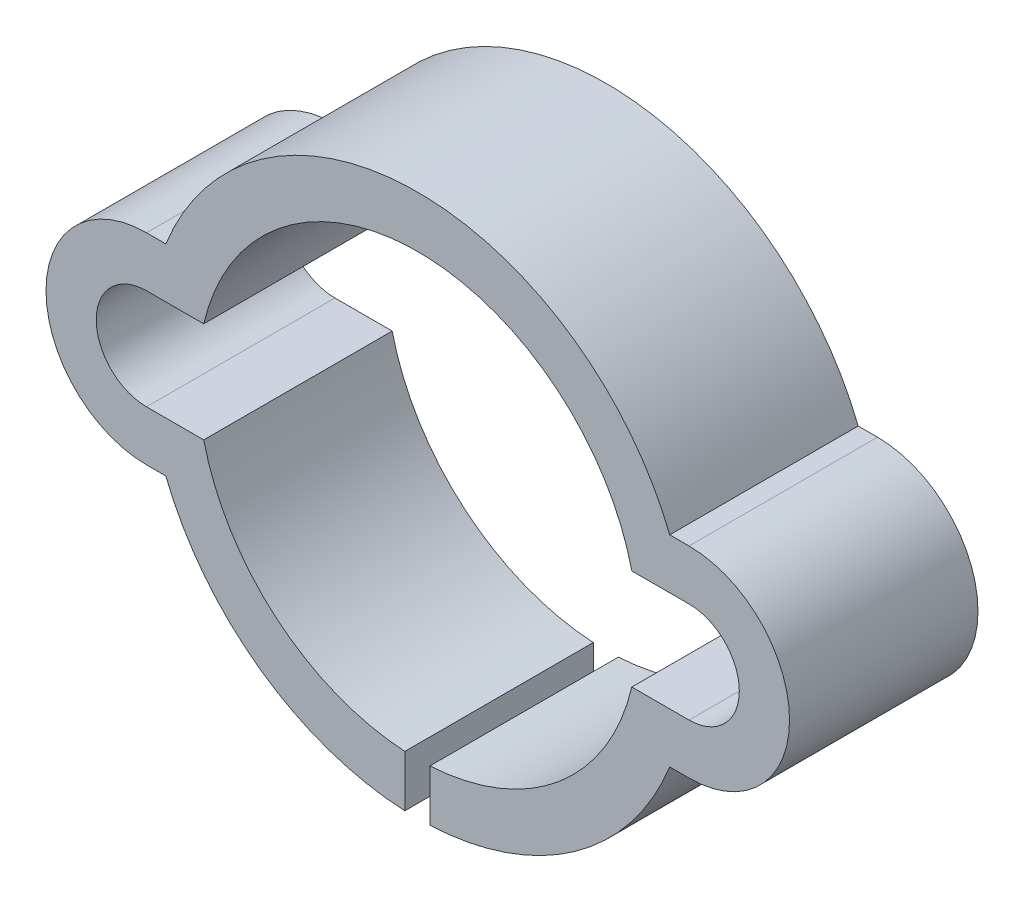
ISO-10303-21;
HEADER;
FILE_DESCRIPTION(('STEP AP214'),'2;1');
FILE_NAME('part.step','',(''),(''),'','','');
FILE_SCHEMA(('AUTOMOTIVE_DESIGN { 1 0 10303 214 1 1 1 1 }'));
ENDSEC;
DATA;
#1=APPLICATION_CONTEXT('core data for automotive mechanical design processes');
#2=APPLICATION_PROTOCOL_DEFINITION('international standard','automotive_design',2000,#1);
#3=PRODUCT_CONTEXT('',#1,'mechanical');
#4=PRODUCT('Part','Part','',(#3));
#5=PRODUCT_RELATED_PRODUCT_CATEGORY('part','',(#4));
#6=PRODUCT_DEFINITION_FORMATION('','',#4);
#7=PRODUCT_DEFINITION_CONTEXT('part definition',#1,'design');
#8=PRODUCT_DEFINITION('design','',#6,#7);
#9=PRODUCT_DEFINITION_SHAPE('','',#8);
#10=(LENGTH_UNIT() NAMED_UNIT(*) SI_UNIT(.MILLI.,.METRE.));
#11=(NAMED_UNIT(*) PLANE_ANGLE_UNIT() SI_UNIT($,.RADIAN.));
#12=(NAMED_UNIT(*) SI_UNIT($,.STERADIAN.) SOLID_ANGLE_UNIT());
#13=UNCERTAINTY_MEASURE_WITH_UNIT(LENGTH_MEASURE(1.E-05),#10,'distance_accuracy_value','');
#14=(GEOMETRIC_REPRESENTATION_CONTEXT(3) GLOBAL_UNCERTAINTY_ASSIGNED_CONTEXT((#13)) GLOBAL_UNIT_ASSIGNED_CONTEXT((#10,
#11,#12)) REPRESENTATION_CONTEXT('',''));
#15=CARTESIAN_POINT('',(0.,0.,0.));
#16=DIRECTION('',(0.,0.,1.));
#17=DIRECTION('',(1.,0.,0.));
#18=AXIS2_PLACEMENT_3D('',#15,#16,#17);
#19=CARTESIAN_POINT('',(0.,0.,3.));
#20=DIRECTION('',(0.,0.,-1.));
#21=DIRECTION('',(-1.,0.,0.));
#22=AXIS2_PLACEMENT_3D('',#19,#20,#21);
#23=CYLINDRICAL_SURFACE('',#22,4.31837483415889);
#24=CARTESIAN_POINT('',(0.,0.,0.));
#25=DIRECTION('',(0.,0.,1.));
#26=DIRECTION('',(1.,0.,0.));
#27=AXIS2_PLACEMENT_3D('',#24,#25,#26);
#28=CIRCLE('',#27,4.31837483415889);
#29=CARTESIAN_POINT('',(4.01102994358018,1.6,0.));
#30=VERTEX_POINT('',#29);
#31=CARTESIAN_POINT('',(-4.01102994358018,1.6,0.));
#32=VERTEX_POINT('',#31);
#33=EDGE_CURVE('E212',#30,#32,#28,.T.);
#34=ORIENTED_EDGE('',*,*,#33,.T.);
#35=DIRECTION('',(0.,0.,-1.));
#36=VECTOR('',#35,1.);
#37=CARTESIAN_POINT('',(-4.01102994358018,1.6,3.));
#38=LINE('',#37,#36);
#39=CARTESIAN_POINT('',(-4.01102994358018,1.6,3.));
#40=VERTEX_POINT('',#39);
#41=EDGE_CURVE('E11',#40,#32,#38,.T.);
#42=ORIENTED_EDGE('',*,*,#41,.F.);
#43=CARTESIAN_POINT('',(0.,0.,3.));
#44=DIRECTION('',(0.,0.,1.));
#45=DIRECTION('',(1.,0.,0.));
#46=AXIS2_PLACEMENT_3D('',#43,#44,#45);
#47=CIRCLE('',#46,4.31837483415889);
#48=CARTESIAN_POINT('',(4.01102994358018,1.6,3.));
#49=VERTEX_POINT('',#48);
#50=EDGE_CURVE('E270',#49,#40,#47,.T.);
#51=ORIENTED_EDGE('',*,*,#50,.F.);
#52=DIRECTION('',(0.,0.,-1.));
#53=VECTOR('',#52,1.);
#54=CARTESIAN_POINT('',(4.01102994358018,1.6,3.));
#55=LINE('',#54,#53);
#56=EDGE_CURVE('E208',#49,#30,#55,.T.);
#57=ORIENTED_EDGE('',*,*,#56,.T.);
#58=EDGE_LOOP('',(#34,#42,#51,#57));
#59=FACE_BOUND('',#58,.T.);
#60=ADVANCED_FACE('F39',(#59),#23,.T.);
#61=CARTESIAN_POINT('',(-4.31837483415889,1.6,3.));
#62=DIRECTION('',(0.,-1.,0.));
#63=DIRECTION('',(0.,0.,-1.));
#64=AXIS2_PLACEMENT_3D('',#61,#62,#63);
#65=PLANE('',#64);
#66=DIRECTION('',(-1.,0.,0.));
#67=VECTOR('',#66,1.);
#68=CARTESIAN_POINT('',(-4.31837483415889,1.6,0.));
#69=LINE('',#68,#67);
#70=CARTESIAN_POINT('',(-4.31837483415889,1.6,0.));
#71=VERTEX_POINT('',#70);
#72=EDGE_CURVE('E216',#32,#71,#69,.T.);
#73=ORIENTED_EDGE('',*,*,#72,.T.);
#74=DIRECTION('',(0.,0.,-1.));
#75=VECTOR('',#74,1.);
#76=CARTESIAN_POINT('',(-4.31837483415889,1.6,3.));
#77=LINE('',#76,#75);
#78=CARTESIAN_POINT('',(-4.31837483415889,1.6,3.));
#79=VERTEX_POINT('',#78);
#80=EDGE_CURVE('E48',#79,#71,#77,.T.);
#81=ORIENTED_EDGE('',*,*,#80,.F.);
#82=DIRECTION('',(-1.,0.,0.));
#83=VECTOR('',#82,1.);
#84=CARTESIAN_POINT('',(-4.31837483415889,1.6,3.));
#85=LINE('',#84,#83);
#86=EDGE_CURVE('E135',#40,#79,#85,.T.);
#87=ORIENTED_EDGE('',*,*,#86,.F.);
#88=ORIENTED_EDGE('',*,*,#41,.T.);
#89=EDGE_LOOP('',(#73,#81,#87,#88));
#90=FACE_BOUND('',#89,.T.);
#91=ADVANCED_FACE('F420',(#90),#65,.F.);
#92=CARTESIAN_POINT('',(-4.31837483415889,0.,3.));
#93=DIRECTION('',(0.,0.,-1.));
#94=DIRECTION('',(-1.,0.,0.));
#95=AXIS2_PLACEMENT_3D('',#92,#93,#94);
#96=CYLINDRICAL_SURFACE('',#95,1.6);
#97=CARTESIAN_POINT('',(-4.31837483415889,0.,0.));
#98=DIRECTION('',(0.,0.,1.));
#99=DIRECTION('',(1.,0.,0.));
#100=AXIS2_PLACEMENT_3D('',#97,#98,#99);
#101=CIRCLE('',#100,1.6);
#102=CARTESIAN_POINT('',(-4.31837483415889,-1.6,0.));
#103=VERTEX_POINT('',#102);
#104=EDGE_CURVE('E219',#71,#103,#101,.T.);
#105=ORIENTED_EDGE('',*,*,#104,.T.);
#106=DIRECTION('',(0.,0.,-1.));
#107=VECTOR('',#106,1.);
#108=CARTESIAN_POINT('',(-4.31837483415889,-1.6,3.));
#109=LINE('',#108,#107);
#110=CARTESIAN_POINT('',(-4.31837483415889,-1.6,3.));
#111=VERTEX_POINT('',#110);
#112=EDGE_CURVE('E329',#111,#103,#109,.T.);
#113=ORIENTED_EDGE('',*,*,#112,.F.);
#114=CARTESIAN_POINT('',(-4.31837483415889,0.,3.));
#115=DIRECTION('',(0.,0.,1.));
#116=DIRECTION('',(1.,0.,0.));
#117=AXIS2_PLACEMENT_3D('',#114,#115,#116);
#118=CIRCLE('',#117,1.6);
#119=EDGE_CURVE('E339',#79,#111,#118,.T.);
#120=ORIENTED_EDGE('',*,*,#119,.F.);
#121=ORIENTED_EDGE('',*,*,#80,.T.);
#122=EDGE_LOOP('',(#105,#113,#120,#121));
#123=FACE_BOUND('',#122,.T.);
#124=ADVANCED_FACE('F337',(#123),#96,.T.);
#125=CARTESIAN_POINT('',(-4.31837483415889,-1.6,3.));
#126=DIRECTION('',(0.,1.,0.));
#127=DIRECTION('',(0.,0.,1.));
#128=AXIS2_PLACEMENT_3D('',#125,#126,#127);
#129=PLANE('',#128);
#130=DIRECTION('',(1.,0.,0.));
#131=VECTOR('',#130,1.);
#132=CARTESIAN_POINT('',(-4.31837483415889,-1.6,0.));
#133=LINE('',#132,#131);
#134=CARTESIAN_POINT('',(-4.01102994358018,-1.6,0.));
#135=VERTEX_POINT('',#134);
#136=EDGE_CURVE('E222',#103,#135,#133,.T.);
#137=ORIENTED_EDGE('',*,*,#136,.T.);
#138=DIRECTION('',(0.,0.,-1.));
#139=VECTOR('',#138,1.);
#140=CARTESIAN_POINT('',(-4.01102994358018,-1.6,3.));
#141=LINE('',#140,#139);
#142=CARTESIAN_POINT('',(-4.01102994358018,-1.6,3.));
#143=VERTEX_POINT('',#142);
#144=EDGE_CURVE('E325',#143,#135,#141,.T.);
#145=ORIENTED_EDGE('',*,*,#144,.F.);
#146=DIRECTION('',(1.,0.,0.));
#147=VECTOR('',#146,1.);
#148=CARTESIAN_POINT('',(-4.31837483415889,-1.6,3.));
#149=LINE('',#148,#147);
#150=EDGE_CURVE('E358',#111,#143,#149,.T.);
#151=ORIENTED_EDGE('',*,*,#150,.F.);
#152=ORIENTED_EDGE('',*,*,#112,.T.);
#153=EDGE_LOOP('',(#137,#145,#151,#152));
#154=FACE_BOUND('',#153,.T.);
#155=ADVANCED_FACE('F348',(#154),#129,.F.);
#156=CARTESIAN_POINT('',(0.,0.,3.));
#157=DIRECTION('',(0.,0.,-1.));
#158=DIRECTION('',(-1.,0.,0.));
#159=AXIS2_PLACEMENT_3D('',#156,#157,#158);
#160=CYLINDRICAL_SURFACE('',#159,4.31837483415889);
#161=CARTESIAN_POINT('',(0.,0.,0.));
#162=DIRECTION('',(0.,0.,1.));
#163=DIRECTION('',(1.,0.,0.));
#164=AXIS2_PLACEMENT_3D('',#161,#162,#163);
#165=CIRCLE('',#164,4.31837483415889);
#166=CARTESIAN_POINT('',(-0.205945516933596,-4.31346121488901,0.));
#167=VERTEX_POINT('',#166);
#168=EDGE_CURVE('E225',#135,#167,#165,.T.);
#169=ORIENTED_EDGE('',*,*,#168,.T.);
#170=DIRECTION('',(0.,0.,-1.));
#171=VECTOR('',#170,1.);
#172=CARTESIAN_POINT('',(-0.205945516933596,-4.31346121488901,3.));
#173=LINE('',#172,#171);
#174=CARTESIAN_POINT('',(-0.205945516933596,-4.31346121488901,3.));
#175=VERTEX_POINT('',#174);
#176=EDGE_CURVE('E321',#175,#167,#173,.T.);
#177=ORIENTED_EDGE('',*,*,#176,.F.);
#178=CARTESIAN_POINT('',(0.,0.,3.));
#179=DIRECTION('',(0.,0.,1.));
#180=DIRECTION('',(1.,0.,0.));
#181=AXIS2_PLACEMENT_3D('',#178,#179,#180);
#182=CIRCLE('',#181,4.31837483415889);
#183=EDGE_CURVE('E354',#143,#175,#182,.T.);
#184=ORIENTED_EDGE('',*,*,#183,.F.);
#185=ORIENTED_EDGE('',*,*,#144,.T.);
#186=EDGE_LOOP('',(#169,#177,#184,#185));
#187=FACE_BOUND('',#186,.T.);
#188=ADVANCED_FACE('F352',(#187),#160,.T.);
#189=CARTESIAN_POINT('',(-0.205945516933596,-3.49393566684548,3.));
#190=DIRECTION('',(-1.,0.,0.));
#191=DIRECTION('',(0.,0.,1.));
#192=AXIS2_PLACEMENT_3D('',#189,#190,#191);
#193=PLANE('',#192);
#194=DIRECTION('',(0.,1.,0.));
#195=VECTOR('',#194,1.);
#196=CARTESIAN_POINT('',(-0.205945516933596,-3.49393566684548,0.));
#197=LINE('',#196,#195);
#198=CARTESIAN_POINT('',(-0.205945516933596,-3.49393566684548,0.));
#199=VERTEX_POINT('',#198);
#200=EDGE_CURVE('E228',#167,#199,#197,.T.);
#201=ORIENTED_EDGE('',*,*,#200,.T.);
#202=DIRECTION('',(0.,0.,-1.));
#203=VECTOR('',#202,1.);
#204=CARTESIAN_POINT('',(-0.205945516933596,-3.49393566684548,3.));
#205=LINE('',#204,#203);
#206=CARTESIAN_POINT('',(-0.205945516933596,-3.49393566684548,3.));
#207=VERTEX_POINT('',#206);
#208=EDGE_CURVE('E317',#207,#199,#205,.T.);
#209=ORIENTED_EDGE('',*,*,#208,.F.);
#210=DIRECTION('',(0.,1.,0.));
#211=VECTOR('',#210,1.);
#212=CARTESIAN_POINT('',(-0.205945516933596,-3.49393566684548,3.));
#213=LINE('',#212,#211);
#214=EDGE_CURVE('E357',#175,#207,#213,.T.);
#215=ORIENTED_EDGE('',*,*,#214,.F.);
#216=ORIENTED_EDGE('',*,*,#176,.T.);
#217=EDGE_LOOP('',(#201,#209,#215,#216));
#218=FACE_BOUND('',#217,.T.);
#219=ADVANCED_FACE('F433',(#218),#193,.F.);
#220=CARTESIAN_POINT('',(0.,0.,3.));
#221=DIRECTION('',(0.,0.,-1.));
#222=DIRECTION('',(-1.,0.,0.));
#223=AXIS2_PLACEMENT_3D('',#220,#221,#222);
#224=CYLINDRICAL_SURFACE('',#223,3.5);
#225=CARTESIAN_POINT('',(0.,0.,0.));
#226=DIRECTION('',(0.,0.,-1.));
#227=DIRECTION('',(1.,0.,0.));
#228=AXIS2_PLACEMENT_3D('',#225,#226,#227);
#229=CIRCLE('',#228,3.5);
#230=CARTESIAN_POINT('',(-3.40734500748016,-0.8,0.));
#231=VERTEX_POINT('',#230);
#232=EDGE_CURVE('E231',#199,#231,#229,.T.);
#233=ORIENTED_EDGE('',*,*,#232,.T.);
#234=DIRECTION('',(0.,0.,-1.));
#235=VECTOR('',#234,1.);
#236=CARTESIAN_POINT('',(-3.40734500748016,-0.8,3.));
#237=LINE('',#236,#235);
#238=CARTESIAN_POINT('',(-3.40734500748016,-0.8,3.));
#239=VERTEX_POINT('',#238);
#240=EDGE_CURVE('E313',#239,#231,#237,.T.);
#241=ORIENTED_EDGE('',*,*,#240,.F.);
#242=CARTESIAN_POINT('',(0.,0.,3.));
#243=DIRECTION('',(0.,0.,-1.));
#244=DIRECTION('',(1.,0.,0.));
#245=AXIS2_PLACEMENT_3D('',#242,#243,#244);
#246=CIRCLE('',#245,3.5);
#247=EDGE_CURVE('E362',#207,#239,#246,.T.);
#248=ORIENTED_EDGE('',*,*,#247,.F.);
#249=ORIENTED_EDGE('',*,*,#208,.T.);
#250=EDGE_LOOP('',(#233,#241,#248,#249));
#251=FACE_BOUND('',#250,.T.);
#252=ADVANCED_FACE('F436',(#251),#224,.F.);
#253=CARTESIAN_POINT('',(-4.31837483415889,-0.8,3.));
#254=DIRECTION('',(0.,-1.,0.));
#255=DIRECTION('',(0.,0.,-1.));
#256=AXIS2_PLACEMENT_3D('',#253,#254,#255);
#257=PLANE('',#256);
#258=DIRECTION('',(-1.,0.,0.));
#259=VECTOR('',#258,1.);
#260=CARTESIAN_POINT('',(-4.31837483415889,-0.8,0.));
#261=LINE('',#260,#259);
#262=CARTESIAN_POINT('',(-4.31837483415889,-0.8,0.));
#263=VERTEX_POINT('',#262);
#264=EDGE_CURVE('E234',#231,#263,#261,.T.);
#265=ORIENTED_EDGE('',*,*,#264,.T.);
#266=DIRECTION('',(0.,0.,-1.));
#267=VECTOR('',#266,1.);
#268=CARTESIAN_POINT('',(-4.31837483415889,-0.8,3.));
#269=LINE('',#268,#267);
#270=CARTESIAN_POINT('',(-4.31837483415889,-0.8,3.));
#271=VERTEX_POINT('',#270);
#272=EDGE_CURVE('E309',#271,#263,#269,.T.);
#273=ORIENTED_EDGE('',*,*,#272,.F.);
#274=DIRECTION('',(-1.,0.,0.));
#275=VECTOR('',#274,1.);
#276=CARTESIAN_POINT('',(-4.31837483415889,-0.8,3.));
#277=LINE('',#276,#275);
#278=EDGE_CURVE('E369',#239,#271,#277,.T.);
#279=ORIENTED_EDGE('',*,*,#278,.F.);
#280=ORIENTED_EDGE('',*,*,#240,.T.);
#281=EDGE_LOOP('',(#265,#273,#279,#280));
#282=FACE_BOUND('',#281,.T.);
#283=ADVANCED_FACE('F440',(#282),#257,.F.);
#284=CARTESIAN_POINT('',(-4.31837483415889,0.,3.));
#285=DIRECTION('',(0.,0.,-1.));
#286=DIRECTION('',(-1.,0.,0.));
#287=AXIS2_PLACEMENT_3D('',#284,#285,#286);
#288=CYLINDRICAL_SURFACE('',#287,0.8);
#289=CARTESIAN_POINT('',(-4.31837483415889,0.,0.));
#290=DIRECTION('',(0.,0.,-1.));
#291=DIRECTION('',(1.,0.,0.));
#292=AXIS2_PLACEMENT_3D('',#289,#290,#291);
#293=CIRCLE('',#292,0.8);
#294=CARTESIAN_POINT('',(-4.31837483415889,0.8,0.));
#295=VERTEX_POINT('',#294);
#296=EDGE_CURVE('E237',#263,#295,#293,.T.);
#297=ORIENTED_EDGE('',*,*,#296,.T.);
#298=DIRECTION('',(0.,0.,-1.));
#299=VECTOR('',#298,1.);
#300=CARTESIAN_POINT('',(-4.31837483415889,0.8,3.));
#301=LINE('',#300,#299);
#302=CARTESIAN_POINT('',(-4.31837483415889,0.8,3.));
#303=VERTEX_POINT('',#302);
#304=EDGE_CURVE('E305',#303,#295,#301,.T.);
#305=ORIENTED_EDGE('',*,*,#304,.F.);
#306=CARTESIAN_POINT('',(-4.31837483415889,0.,3.));
#307=DIRECTION('',(0.,0.,-1.));
#308=DIRECTION('',(1.,0.,0.));
#309=AXIS2_PLACEMENT_3D('',#306,#307,#308);
#310=CIRCLE('',#309,0.8);
#311=EDGE_CURVE('E372',#271,#303,#310,.T.);
#312=ORIENTED_EDGE('',*,*,#311,.F.);
#313=ORIENTED_EDGE('',*,*,#272,.T.);
#314=EDGE_LOOP('',(#297,#305,#312,#313));
#315=FACE_BOUND('',#314,.T.);
#316=ADVANCED_FACE('F444',(#315),#288,.F.);
#317=CARTESIAN_POINT('',(-4.31837483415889,0.8,3.));
#318=DIRECTION('',(0.,1.,0.));
#319=DIRECTION('',(0.,0.,1.));
#320=AXIS2_PLACEMENT_3D('',#317,#318,#319);
#321=PLANE('',#320);
#322=DIRECTION('',(1.,0.,0.));
#323=VECTOR('',#322,1.);
#324=CARTESIAN_POINT('',(-4.31837483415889,0.8,0.));
#325=LINE('',#324,#323);
#326=CARTESIAN_POINT('',(-3.40734500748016,0.8,0.));
#327=VERTEX_POINT('',#326);
#328=EDGE_CURVE('E240',#295,#327,#325,.T.);
#329=ORIENTED_EDGE('',*,*,#328,.T.);
#330=DIRECTION('',(0.,0.,-1.));
#331=VECTOR('',#330,1.);
#332=CARTESIAN_POINT('',(-3.40734500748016,0.8,3.));
#333=LINE('',#332,#331);
#334=CARTESIAN_POINT('',(-3.40734500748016,0.8,3.));
#335=VERTEX_POINT('',#334);
#336=EDGE_CURVE('E301',#335,#327,#333,.T.);
#337=ORIENTED_EDGE('',*,*,#336,.F.);
#338=DIRECTION('',(1.,0.,0.));
#339=VECTOR('',#338,1.);
#340=CARTESIAN_POINT('',(-4.31837483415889,0.8,3.));
#341=LINE('',#340,#339);
#342=EDGE_CURVE('E375',#303,#335,#341,.T.);
#343=ORIENTED_EDGE('',*,*,#342,.F.);
#344=ORIENTED_EDGE('',*,*,#304,.T.);
#345=EDGE_LOOP('',(#329,#337,#343,#344));
#346=FACE_BOUND('',#345,.T.);
#347=ADVANCED_FACE('F448',(#346),#321,.F.);
#348=CARTESIAN_POINT('',(0.,0.,3.));
#349=DIRECTION('',(0.,0.,-1.));
#350=DIRECTION('',(-1.,0.,0.));
#351=AXIS2_PLACEMENT_3D('',#348,#349,#350);
#352=CYLINDRICAL_SURFACE('',#351,3.5);
#353=CARTESIAN_POINT('',(0.,0.,0.));
#354=DIRECTION('',(0.,0.,-1.));
#355=DIRECTION('',(1.,0.,0.));
#356=AXIS2_PLACEMENT_3D('',#353,#354,#355);
#357=CIRCLE('',#356,3.5);
#358=CARTESIAN_POINT('',(3.40734500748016,0.8,0.));
#359=VERTEX_POINT('',#358);
#360=EDGE_CURVE('E243',#327,#359,#357,.T.);
#361=ORIENTED_EDGE('',*,*,#360,.T.);
#362=DIRECTION('',(0.,0.,-1.));
#363=VECTOR('',#362,1.);
#364=CARTESIAN_POINT('',(3.40734500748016,0.8,3.));
#365=LINE('',#364,#363);
#366=CARTESIAN_POINT('',(3.40734500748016,0.8,3.));
#367=VERTEX_POINT('',#366);
#368=EDGE_CURVE('E297',#367,#359,#365,.T.);
#369=ORIENTED_EDGE('',*,*,#368,.F.);
#370=CARTESIAN_POINT('',(0.,0.,3.));
#371=DIRECTION('',(0.,0.,-1.));
#372=DIRECTION('',(1.,0.,0.));
#373=AXIS2_PLACEMENT_3D('',#370,#371,#372);
#374=CIRCLE('',#373,3.5);
#375=EDGE_CURVE('E378',#335,#367,#374,.T.);
#376=ORIENTED_EDGE('',*,*,#375,.F.);
#377=ORIENTED_EDGE('',*,*,#336,.T.);
#378=EDGE_LOOP('',(#361,#369,#376,#377));
#379=FACE_BOUND('',#378,.T.);
#380=ADVANCED_FACE('F452',(#379),#352,.F.);
#381=CARTESIAN_POINT('',(3.40734500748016,0.8,3.));
#382=DIRECTION('',(0.,1.,0.));
#383=DIRECTION('',(0.,0.,1.));
#384=AXIS2_PLACEMENT_3D('',#381,#382,#383);
#385=PLANE('',#384);
#386=DIRECTION('',(1.,0.,0.));
#387=VECTOR('',#386,1.);
#388=CARTESIAN_POINT('',(3.40734500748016,0.8,0.));
#389=LINE('',#388,#387);
#390=CARTESIAN_POINT('',(4.31837483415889,0.8,0.));
#391=VERTEX_POINT('',#390);
#392=EDGE_CURVE('E246',#359,#391,#389,.T.);
#393=ORIENTED_EDGE('',*,*,#392,.T.);
#394=DIRECTION('',(0.,0.,-1.));
#395=VECTOR('',#394,1.);
#396=CARTESIAN_POINT('',(4.31837483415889,0.8,3.));
#397=LINE('',#396,#395);
#398=CARTESIAN_POINT('',(4.31837483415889,0.8,3.));
#399=VERTEX_POINT('',#398);
#400=EDGE_CURVE('E293',#399,#391,#397,.T.);
#401=ORIENTED_EDGE('',*,*,#400,.F.);
#402=DIRECTION('',(1.,0.,0.));
#403=VECTOR('',#402,1.);
#404=CARTESIAN_POINT('',(3.40734500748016,0.8,3.));
#405=LINE('',#404,#403);
#406=EDGE_CURVE('E381',#367,#399,#405,.T.);
#407=ORIENTED_EDGE('',*,*,#406,.F.);
#408=ORIENTED_EDGE('',*,*,#368,.T.);
#409=EDGE_LOOP('',(#393,#401,#407,#408));
#410=FACE_BOUND('',#409,.T.);
#411=ADVANCED_FACE('F456',(#410),#385,.F.);
#412=CARTESIAN_POINT('',(4.31837483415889,0.,3.));
#413=DIRECTION('',(0.,0.,-1.));
#414=DIRECTION('',(-1.,0.,0.));
#415=AXIS2_PLACEMENT_3D('',#412,#413,#414);
#416=CYLINDRICAL_SURFACE('',#415,0.8);
#417=CARTESIAN_POINT('',(4.31837483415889,0.,0.));
#418=DIRECTION('',(0.,0.,-1.));
#419=DIRECTION('',(1.,0.,0.));
#420=AXIS2_PLACEMENT_3D('',#417,#418,#419);
#421=CIRCLE('',#420,0.8);
#422=CARTESIAN_POINT('',(4.31837483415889,-0.8,0.));
#423=VERTEX_POINT('',#422);
#424=EDGE_CURVE('E249',#391,#423,#421,.T.);
#425=ORIENTED_EDGE('',*,*,#424,.T.);
#426=DIRECTION('',(0.,0.,-1.));
#427=VECTOR('',#426,1.);
#428=CARTESIAN_POINT('',(4.31837483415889,-0.8,3.));
#429=LINE('',#428,#427);
#430=CARTESIAN_POINT('',(4.31837483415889,-0.8,3.));
#431=VERTEX_POINT('',#430);
#432=EDGE_CURVE('E289',#431,#423,#429,.T.);
#433=ORIENTED_EDGE('',*,*,#432,.F.);
#434=CARTESIAN_POINT('',(4.31837483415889,0.,3.));
#435=DIRECTION('',(0.,0.,-1.));
#436=DIRECTION('',(1.,0.,0.));
#437=AXIS2_PLACEMENT_3D('',#434,#435,#436);
#438=CIRCLE('',#437,0.8);
#439=EDGE_CURVE('E384',#399,#431,#438,.T.);
#440=ORIENTED_EDGE('',*,*,#439,.F.);
#441=ORIENTED_EDGE('',*,*,#400,.T.);
#442=EDGE_LOOP('',(#425,#433,#440,#441));
#443=FACE_BOUND('',#442,.T.);
#444=ADVANCED_FACE('F460',(#443),#416,.F.);
#445=CARTESIAN_POINT('',(3.40734500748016,-0.8,3.));
#446=DIRECTION('',(0.,-1.,0.));
#447=DIRECTION('',(0.,0.,-1.));
#448=AXIS2_PLACEMENT_3D('',#445,#446,#447);
#449=PLANE('',#448);
#450=DIRECTION('',(-1.,0.,0.));
#451=VECTOR('',#450,1.);
#452=CARTESIAN_POINT('',(3.40734500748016,-0.8,0.));
#453=LINE('',#452,#451);
#454=CARTESIAN_POINT('',(3.40734500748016,-0.800000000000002,0.));
#455=VERTEX_POINT('',#454);
#456=EDGE_CURVE('E252',#423,#455,#453,.T.);
#457=ORIENTED_EDGE('',*,*,#456,.T.);
#458=DIRECTION('',(0.,0.,-1.));
#459=VECTOR('',#458,1.);
#460=CARTESIAN_POINT('',(3.40734500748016,-0.800000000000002,3.));
#461=LINE('',#460,#459);
#462=CARTESIAN_POINT('',(3.40734500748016,-0.800000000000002,3.));
#463=VERTEX_POINT('',#462);
#464=EDGE_CURVE('E285',#463,#455,#461,.T.);
#465=ORIENTED_EDGE('',*,*,#464,.F.);
#466=DIRECTION('',(-1.,0.,0.));
#467=VECTOR('',#466,1.);
#468=CARTESIAN_POINT('',(3.40734500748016,-0.8,3.));
#469=LINE('',#468,#467);
#470=EDGE_CURVE('E387',#431,#463,#469,.T.);
#471=ORIENTED_EDGE('',*,*,#470,.F.);
#472=ORIENTED_EDGE('',*,*,#432,.T.);
#473=EDGE_LOOP('',(#457,#465,#471,#472));
#474=FACE_BOUND('',#473,.T.);
#475=ADVANCED_FACE('F464',(#474),#449,.F.);
#476=CARTESIAN_POINT('',(0.,0.,3.));
#477=DIRECTION('',(0.,0.,-1.));
#478=DIRECTION('',(-1.,0.,0.));
#479=AXIS2_PLACEMENT_3D('',#476,#477,#478);
#480=CYLINDRICAL_SURFACE('',#479,3.5);
#481=CARTESIAN_POINT('',(0.,0.,0.));
#482=DIRECTION('',(0.,0.,-1.));
#483=DIRECTION('',(1.,0.,0.));
#484=AXIS2_PLACEMENT_3D('',#481,#482,#483);
#485=CIRCLE('',#484,3.5);
#486=CARTESIAN_POINT('',(0.193174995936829,-3.49466499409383,0.));
#487=VERTEX_POINT('',#486);
#488=EDGE_CURVE('E255',#455,#487,#485,.T.);
#489=ORIENTED_EDGE('',*,*,#488,.T.);
#490=DIRECTION('',(0.,0.,-1.));
#491=VECTOR('',#490,1.);
#492=CARTESIAN_POINT('',(0.193174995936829,-3.49466499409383,3.));
#493=LINE('',#492,#491);
#494=CARTESIAN_POINT('',(0.193174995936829,-3.49466499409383,3.));
#495=VERTEX_POINT('',#494);
#496=EDGE_CURVE('E281',#495,#487,#493,.T.);
#497=ORIENTED_EDGE('',*,*,#496,.F.);
#498=CARTESIAN_POINT('',(0.,0.,3.));
#499=DIRECTION('',(0.,0.,-1.));
#500=DIRECTION('',(1.,0.,0.));
#501=AXIS2_PLACEMENT_3D('',#498,#499,#500);
#502=CIRCLE('',#501,3.5);
#503=EDGE_CURVE('E390',#463,#495,#502,.T.);
#504=ORIENTED_EDGE('',*,*,#503,.F.);
#505=ORIENTED_EDGE('',*,*,#464,.T.);
#506=EDGE_LOOP('',(#489,#497,#504,#505));
#507=FACE_BOUND('',#506,.T.);
#508=ADVANCED_FACE('F468',(#507),#480,.F.);
#509=CARTESIAN_POINT('',(0.193174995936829,-3.49466499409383,3.));
#510=DIRECTION('',(1.,0.,0.));
#511=DIRECTION('',(0.,0.,-1.));
#512=AXIS2_PLACEMENT_3D('',#509,#510,#511);
#513=PLANE('',#512);
#514=DIRECTION('',(0.,-1.,0.));
#515=VECTOR('',#514,1.);
#516=CARTESIAN_POINT('',(0.193174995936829,-3.49466499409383,0.));
#517=LINE('',#516,#515);
#518=CARTESIAN_POINT('',(0.193174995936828,-4.3140519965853,0.));
#519=VERTEX_POINT('',#518);
#520=EDGE_CURVE('E258',#487,#519,#517,.T.);
#521=ORIENTED_EDGE('',*,*,#520,.T.);
#522=DIRECTION('',(0.,0.,-1.));
#523=VECTOR('',#522,1.);
#524=CARTESIAN_POINT('',(0.193174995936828,-4.3140519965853,3.));
#525=LINE('',#524,#523);
#526=CARTESIAN_POINT('',(0.193174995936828,-4.3140519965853,3.));
#527=VERTEX_POINT('',#526);
#528=EDGE_CURVE('E277',#527,#519,#525,.T.);
#529=ORIENTED_EDGE('',*,*,#528,.F.);
#530=DIRECTION('',(0.,-1.,0.));
#531=VECTOR('',#530,1.);
#532=CARTESIAN_POINT('',(0.193174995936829,-3.49466499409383,3.));
#533=LINE('',#532,#531);
#534=EDGE_CURVE('E393',#495,#527,#533,.T.);
#535=ORIENTED_EDGE('',*,*,#534,.F.);
#536=ORIENTED_EDGE('',*,*,#496,.T.);
#537=EDGE_LOOP('',(#521,#529,#535,#536));
#538=FACE_BOUND('',#537,.T.);
#539=ADVANCED_FACE('F401',(#538),#513,.F.);
#540=CARTESIAN_POINT('',(0.,0.,3.));
#541=DIRECTION('',(0.,0.,-1.));
#542=DIRECTION('',(-1.,0.,0.));
#543=AXIS2_PLACEMENT_3D('',#540,#541,#542);
#544=CYLINDRICAL_SURFACE('',#543,4.31837483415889);
#545=CARTESIAN_POINT('',(0.,0.,0.));
#546=DIRECTION('',(0.,0.,1.));
#547=DIRECTION('',(1.,0.,0.));
#548=AXIS2_PLACEMENT_3D('',#545,#546,#547);
#549=CIRCLE('',#548,4.31837483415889);
#550=CARTESIAN_POINT('',(4.01102994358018,-1.6,0.));
#551=VERTEX_POINT('',#550);
#552=EDGE_CURVE('E261',#519,#551,#549,.T.);
#553=ORIENTED_EDGE('',*,*,#552,.T.);
#554=DIRECTION('',(0.,0.,-1.));
#555=VECTOR('',#554,1.);
#556=CARTESIAN_POINT('',(4.01102994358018,-1.6,3.));
#557=LINE('',#556,#555);
#558=CARTESIAN_POINT('',(4.01102994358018,-1.6,3.));
#559=VERTEX_POINT('',#558);
#560=EDGE_CURVE('E201',#559,#551,#557,.T.);
#561=ORIENTED_EDGE('',*,*,#560,.F.);
#562=CARTESIAN_POINT('',(0.,0.,3.));
#563=DIRECTION('',(0.,0.,1.));
#564=DIRECTION('',(1.,0.,0.));
#565=AXIS2_PLACEMENT_3D('',#562,#563,#564);
#566=CIRCLE('',#565,4.31837483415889);
#567=EDGE_CURVE('E190',#527,#559,#566,.T.);
#568=ORIENTED_EDGE('',*,*,#567,.F.);
#569=ORIENTED_EDGE('',*,*,#528,.T.);
#570=EDGE_LOOP('',(#553,#561,#568,#569));
#571=FACE_BOUND('',#570,.T.);
#572=ADVANCED_FACE('F405',(#571),#544,.T.);
#573=CARTESIAN_POINT('',(4.01102994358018,-1.6,3.));
#574=DIRECTION('',(0.,1.,0.));
#575=DIRECTION('',(0.,0.,1.));
#576=AXIS2_PLACEMENT_3D('',#573,#574,#575);
#577=PLANE('',#576);
#578=DIRECTION('',(1.,0.,0.));
#579=VECTOR('',#578,1.);
#580=CARTESIAN_POINT('',(4.01102994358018,-1.6,0.));
#581=LINE('',#580,#579);
#582=CARTESIAN_POINT('',(4.31837483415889,-1.6,0.));
#583=VERTEX_POINT('',#582);
#584=EDGE_CURVE('E199',#551,#583,#581,.T.);
#585=ORIENTED_EDGE('',*,*,#584,.T.);
#586=DIRECTION('',(0.,0.,-1.));
#587=VECTOR('',#586,1.);
#588=CARTESIAN_POINT('',(4.31837483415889,-1.6,3.));
#589=LINE('',#588,#587);
#590=CARTESIAN_POINT('',(4.31837483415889,-1.6,3.));
#591=VERTEX_POINT('',#590);
#592=EDGE_CURVE('E196',#591,#583,#589,.T.);
#593=ORIENTED_EDGE('',*,*,#592,.F.);
#594=DIRECTION('',(1.,0.,0.));
#595=VECTOR('',#594,1.);
#596=CARTESIAN_POINT('',(4.01102994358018,-1.6,3.));
#597=LINE('',#596,#595);
#598=EDGE_CURVE('E184',#559,#591,#597,.T.);
#599=ORIENTED_EDGE('',*,*,#598,.F.);
#600=ORIENTED_EDGE('',*,*,#560,.T.);
#601=EDGE_LOOP('',(#585,#593,#599,#600));
#602=FACE_BOUND('',#601,.T.);
#603=ADVANCED_FACE('F197',(#602),#577,.F.);
#604=CARTESIAN_POINT('',(4.31837483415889,0.,3.));
#605=DIRECTION('',(0.,0.,-1.));
#606=DIRECTION('',(-1.,0.,0.));
#607=AXIS2_PLACEMENT_3D('',#604,#605,#606);
#608=CYLINDRICAL_SURFACE('',#607,1.6);
#609=CARTESIAN_POINT('',(4.31837483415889,0.,0.));
#610=DIRECTION('',(0.,0.,1.));
#611=DIRECTION('',(1.,0.,0.));
#612=AXIS2_PLACEMENT_3D('',#609,#610,#611);
#613=CIRCLE('',#612,1.6);
#614=CARTESIAN_POINT('',(4.31837483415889,1.6,0.));
#615=VERTEX_POINT('',#614);
#616=EDGE_CURVE('E121',#583,#615,#613,.T.);
#617=ORIENTED_EDGE('',*,*,#616,.T.);
#618=DIRECTION('',(0.,0.,-1.));
#619=VECTOR('',#618,1.);
#620=CARTESIAN_POINT('',(4.31837483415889,1.6,3.));
#621=LINE('',#620,#619);
#622=CARTESIAN_POINT('',(4.31837483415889,1.6,3.));
#623=VERTEX_POINT('',#622);
#624=EDGE_CURVE('E202',#623,#615,#621,.T.);
#625=ORIENTED_EDGE('',*,*,#624,.F.);
#626=CARTESIAN_POINT('',(4.31837483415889,0.,3.));
#627=DIRECTION('',(0.,0.,1.));
#628=DIRECTION('',(1.,0.,0.));
#629=AXIS2_PLACEMENT_3D('',#626,#627,#628);
#630=CIRCLE('',#629,1.6);
#631=EDGE_CURVE('E188',#591,#623,#630,.T.);
#632=ORIENTED_EDGE('',*,*,#631,.F.);
#633=ORIENTED_EDGE('',*,*,#592,.T.);
#634=EDGE_LOOP('',(#617,#625,#632,#633));
#635=FACE_BOUND('',#634,.T.);
#636=ADVANCED_FACE('F204',(#635),#608,.T.);
#637=CARTESIAN_POINT('',(4.01102994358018,1.6,3.));
#638=DIRECTION('',(0.,-1.,0.));
#639=DIRECTION('',(0.,0.,-1.));
#640=AXIS2_PLACEMENT_3D('',#637,#638,#639);
#641=PLANE('',#640);
#642=DIRECTION('',(-1.,0.,0.));
#643=VECTOR('',#642,1.);
#644=CARTESIAN_POINT('',(4.01102994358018,1.6,0.));
#645=LINE('',#644,#643);
#646=EDGE_CURVE('E127',#615,#30,#645,.T.);
#647=ORIENTED_EDGE('',*,*,#646,.T.);
#648=ORIENTED_EDGE('',*,*,#56,.F.);
#649=DIRECTION('',(-1.,0.,0.));
#650=VECTOR('',#649,1.);
#651=CARTESIAN_POINT('',(4.01102994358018,1.6,3.));
#652=LINE('',#651,#650);
#653=EDGE_CURVE('E56',#623,#49,#652,.T.);
#654=ORIENTED_EDGE('',*,*,#653,.F.);
#655=ORIENTED_EDGE('',*,*,#624,.T.);
#656=EDGE_LOOP('',(#647,#648,#654,#655));
#657=FACE_BOUND('',#656,.T.);
#658=ADVANCED_FACE('F409',(#657),#641,.F.);
#659=CARTESIAN_POINT('',(0.,0.,3.));
#660=DIRECTION('',(0.,0.,1.));
#661=DIRECTION('',(1.,0.,0.));
#662=AXIS2_PLACEMENT_3D('',#659,#660,#661);
#663=PLANE('',#662);
#664=ORIENTED_EDGE('',*,*,#50,.T.);
#665=ORIENTED_EDGE('',*,*,#86,.T.);
#666=ORIENTED_EDGE('',*,*,#119,.T.);
#667=ORIENTED_EDGE('',*,*,#150,.T.);
#668=ORIENTED_EDGE('',*,*,#183,.T.);
#669=ORIENTED_EDGE('',*,*,#214,.T.);
#670=ORIENTED_EDGE('',*,*,#247,.T.);
#671=ORIENTED_EDGE('',*,*,#278,.T.);
#672=ORIENTED_EDGE('',*,*,#311,.T.);
#673=ORIENTED_EDGE('',*,*,#342,.T.);
#674=ORIENTED_EDGE('',*,*,#375,.T.);
#675=ORIENTED_EDGE('',*,*,#406,.T.);
#676=ORIENTED_EDGE('',*,*,#439,.T.);
#677=ORIENTED_EDGE('',*,*,#470,.T.);
#678=ORIENTED_EDGE('',*,*,#503,.T.);
#679=ORIENTED_EDGE('',*,*,#534,.T.);
#680=ORIENTED_EDGE('',*,*,#567,.T.);
#681=ORIENTED_EDGE('',*,*,#598,.T.);
#682=ORIENTED_EDGE('',*,*,#631,.T.);
#683=ORIENTED_EDGE('',*,*,#653,.T.);
#684=EDGE_LOOP('',(#664,#665,#666,#667,#668,#669,#670,#671,#672,#673,#674,#675,#676,#677,#678,
#679,#680,#681,#682,#683));
#685=FACE_BOUND('',#684,.T.);
#686=ADVANCED_FACE('F186',(#685),#663,.T.);
#687=CARTESIAN_POINT('',(0.,0.,0.));
#688=DIRECTION('',(0.,0.,1.));
#689=DIRECTION('',(1.,0.,0.));
#690=AXIS2_PLACEMENT_3D('',#687,#688,#689);
#691=PLANE('',#690);
#692=ORIENTED_EDGE('',*,*,#33,.F.);
#693=ORIENTED_EDGE('',*,*,#646,.F.);
#694=ORIENTED_EDGE('',*,*,#616,.F.);
#695=ORIENTED_EDGE('',*,*,#584,.F.);
#696=ORIENTED_EDGE('',*,*,#552,.F.);
#697=ORIENTED_EDGE('',*,*,#520,.F.);
#698=ORIENTED_EDGE('',*,*,#488,.F.);
#699=ORIENTED_EDGE('',*,*,#456,.F.);
#700=ORIENTED_EDGE('',*,*,#424,.F.);
#701=ORIENTED_EDGE('',*,*,#392,.F.);
#702=ORIENTED_EDGE('',*,*,#360,.F.);
#703=ORIENTED_EDGE('',*,*,#328,.F.);
#704=ORIENTED_EDGE('',*,*,#296,.F.);
#705=ORIENTED_EDGE('',*,*,#264,.F.);
#706=ORIENTED_EDGE('',*,*,#232,.F.);
#707=ORIENTED_EDGE('',*,*,#200,.F.);
#708=ORIENTED_EDGE('',*,*,#168,.F.);
#709=ORIENTED_EDGE('',*,*,#136,.F.);
#710=ORIENTED_EDGE('',*,*,#104,.F.);
#711=ORIENTED_EDGE('',*,*,#72,.F.);
#712=EDGE_LOOP('',(#692,#693,#694,#695,#696,#697,#698,#699,#700,#701,#702,#703,#704,#705,#706,
#707,#708,#709,#710,#711));
#713=FACE_BOUND('',#712,.T.);
#714=ADVANCED_FACE('F343',(#713),#691,.F.);
#715=CLOSED_SHELL('',(#60,#91,#124,#155,#188,#219,#252,#283,#316,#347,#380,#411,#444,#475,#508,
#539,#572,#603,#636,#658,#686,#714));
#716=MANIFOLD_SOLID_BREP('B2',#715);
#717=ADVANCED_BREP_SHAPE_REPRESENTATION('',(#18,#716),#14);
#718=SHAPE_DEFINITION_REPRESENTATION(#9,#717);
ENDSEC;
END-ISO-10303-21;
